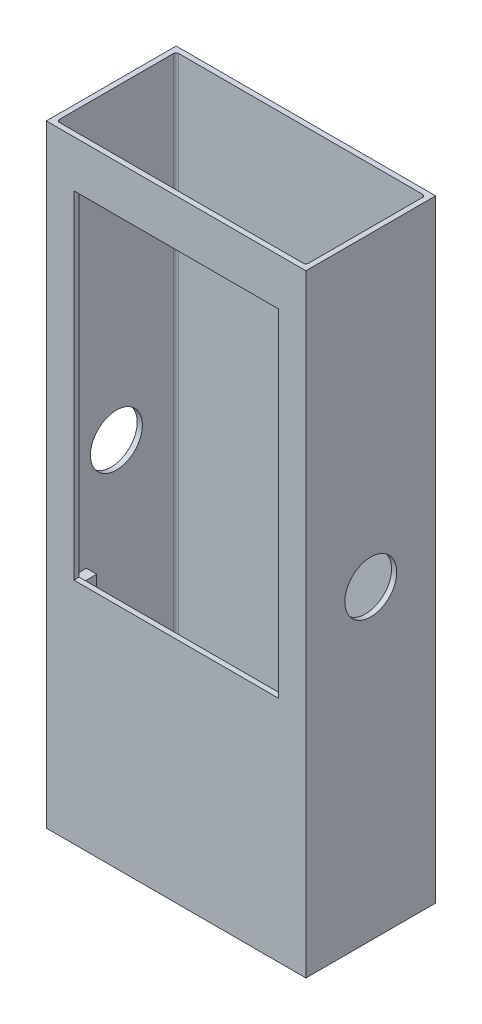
ISO-10303-21;
HEADER;
FILE_DESCRIPTION(('STEP AP214'),'2;1');
FILE_NAME('part.step','',(''),(''),'','','');
FILE_SCHEMA(('AUTOMOTIVE_DESIGN { 1 0 10303 214 1 1 1 1 }'));
ENDSEC;
DATA;
#1=APPLICATION_CONTEXT('core data for automotive mechanical design processes');
#2=APPLICATION_PROTOCOL_DEFINITION('international standard','automotive_design',2000,#1);
#3=PRODUCT_CONTEXT('',#1,'mechanical');
#4=PRODUCT('Part','Part','',(#3));
#5=PRODUCT_RELATED_PRODUCT_CATEGORY('part','',(#4));
#6=PRODUCT_DEFINITION_FORMATION('','',#4);
#7=PRODUCT_DEFINITION_CONTEXT('part definition',#1,'design');
#8=PRODUCT_DEFINITION('design','',#6,#7);
#9=PRODUCT_DEFINITION_SHAPE('','',#8);
#10=(LENGTH_UNIT() NAMED_UNIT(*) SI_UNIT(.MILLI.,.METRE.));
#11=(NAMED_UNIT(*) PLANE_ANGLE_UNIT() SI_UNIT($,.RADIAN.));
#12=(NAMED_UNIT(*) SI_UNIT($,.STERADIAN.) SOLID_ANGLE_UNIT());
#13=UNCERTAINTY_MEASURE_WITH_UNIT(LENGTH_MEASURE(1.E-05),#10,'distance_accuracy_value','');
#14=(GEOMETRIC_REPRESENTATION_CONTEXT(3) GLOBAL_UNCERTAINTY_ASSIGNED_CONTEXT((#13)) GLOBAL_UNIT_ASSIGNED_CONTEXT((#10,
#11,#12)) REPRESENTATION_CONTEXT('',''));
#15=CARTESIAN_POINT('',(0.,0.,0.));
#16=DIRECTION('',(0.,0.,1.));
#17=DIRECTION('',(1.,0.,0.));
#18=AXIS2_PLACEMENT_3D('',#15,#16,#17);
#19=CARTESIAN_POINT('',(0.,-2.53999999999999,-2.54));
#20=DIRECTION('',(0.,0.,-1.));
#21=DIRECTION('',(-1.,0.,0.));
#22=AXIS2_PLACEMENT_3D('',#19,#20,#21);
#23=PLANE('',#22);
#24=DIRECTION('',(1.,0.,0.));
#25=VECTOR('',#24,1.);
#26=CARTESIAN_POINT('',(0.,-17.860000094,-2.54));
#27=LINE('',#26,#25);
#28=CARTESIAN_POINT('',(112.884000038,-17.860000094,-2.54));
#29=VERTEX_POINT('',#28);
#30=CARTESIAN_POINT('',(117.964000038,-17.860000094,-2.54));
#31=VERTEX_POINT('',#30);
#32=EDGE_CURVE('E400',#29,#31,#27,.T.);
#33=ORIENTED_EDGE('',*,*,#32,.F.);
#34=DIRECTION('',(0.,1.,0.));
#35=VECTOR('',#34,1.);
#36=CARTESIAN_POINT('',(112.884000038,0.,-2.54));
#37=LINE('',#36,#35);
#38=CARTESIAN_POINT('',(112.884000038,-22.940000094,-2.54));
#39=VERTEX_POINT('',#38);
#40=EDGE_CURVE('E375',#39,#29,#37,.T.);
#41=ORIENTED_EDGE('',*,*,#40,.F.);
#42=DIRECTION('',(1.,0.,0.));
#43=VECTOR('',#42,1.);
#44=CARTESIAN_POINT('',(0.,-22.940000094,-2.54));
#45=LINE('',#44,#43);
#46=CARTESIAN_POINT('',(117.964000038,-22.940000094,-2.54));
#47=VERTEX_POINT('',#46);
#48=EDGE_CURVE('E381',#39,#47,#45,.T.);
#49=ORIENTED_EDGE('',*,*,#48,.T.);
#50=DIRECTION('',(0.,1.,0.));
#51=VECTOR('',#50,1.);
#52=CARTESIAN_POINT('',(117.964000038,0.,-2.54));
#53=LINE('',#52,#51);
#54=EDGE_CURVE('E404',#47,#31,#53,.T.);
#55=ORIENTED_EDGE('',*,*,#54,.T.);
#56=EDGE_LOOP('',(#33,#41,#49,#55));
#57=FACE_BOUND('',#56,.T.);
#58=DIRECTION('',(0.,1.,0.));
#59=VECTOR('',#58,1.);
#60=CARTESIAN_POINT('',(14.1160384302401,-22.940000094,-2.54));
#61=LINE('',#60,#59);
#62=CARTESIAN_POINT('',(14.1160384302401,-22.940000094,-2.54));
#63=VERTEX_POINT('',#62);
#64=CARTESIAN_POINT('',(14.1160384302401,-17.860000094,-2.54));
#65=VERTEX_POINT('',#64);
#66=EDGE_CURVE('E433',#63,#65,#61,.T.);
#67=ORIENTED_EDGE('',*,*,#66,.T.);
#68=DIRECTION('',(-1.,0.,0.));
#69=VECTOR('',#68,1.);
#70=CARTESIAN_POINT('',(11.5760384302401,-17.860000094,-2.54));
#71=LINE('',#70,#69);
#72=CARTESIAN_POINT('',(9.03603843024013,-17.860000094,-2.54));
#73=VERTEX_POINT('',#72);
#74=EDGE_CURVE('E428',#65,#73,#71,.T.);
#75=ORIENTED_EDGE('',*,*,#74,.T.);
#76=DIRECTION('',(0.,-1.,0.));
#77=VECTOR('',#76,1.);
#78=CARTESIAN_POINT('',(9.03603843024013,-17.860000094,-2.54));
#79=LINE('',#78,#77);
#80=CARTESIAN_POINT('',(9.03603843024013,-22.940000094,-2.54));
#81=VERTEX_POINT('',#80);
#82=EDGE_CURVE('E448',#73,#81,#79,.T.);
#83=ORIENTED_EDGE('',*,*,#82,.T.);
#84=DIRECTION('',(1.,0.,0.));
#85=VECTOR('',#84,1.);
#86=CARTESIAN_POINT('',(9.03603843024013,-22.940000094,-2.54));
#87=LINE('',#86,#85);
#88=EDGE_CURVE('E451',#81,#63,#87,.T.);
#89=ORIENTED_EDGE('',*,*,#88,.T.);
#90=EDGE_LOOP('',(#67,#75,#83,#89));
#91=FACE_BOUND('',#90,.T.);
#92=DIRECTION('',(-1.,0.,0.));
#93=VECTOR('',#92,1.);
#94=CARTESIAN_POINT('',(0.,-190.399999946,-2.54));
#95=LINE('',#94,#93);
#96=CARTESIAN_POINT('',(113.500000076,-190.399999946,-2.54));
#97=VERTEX_POINT('',#96);
#98=CARTESIAN_POINT('',(13.499999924,-190.399999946,-2.54));
#99=VERTEX_POINT('',#98);
#100=EDGE_CURVE('E656',#97,#99,#95,.T.);
#101=ORIENTED_EDGE('',*,*,#100,.F.);
#102=DIRECTION('',(0.,-1.,0.));
#103=VECTOR('',#102,1.);
#104=CARTESIAN_POINT('',(113.500000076,-2.53999999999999,-2.54));
#105=LINE('',#104,#103);
#106=CARTESIAN_POINT('',(113.500000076,-25.4,-2.54));
#107=VERTEX_POINT('',#106);
#108=EDGE_CURVE('E653',#107,#97,#105,.T.);
#109=ORIENTED_EDGE('',*,*,#108,.F.);
#110=DIRECTION('',(1.,0.,0.));
#111=VECTOR('',#110,1.);
#112=CARTESIAN_POINT('',(0.,-25.4,-2.54));
#113=LINE('',#112,#111);
#114=CARTESIAN_POINT('',(13.499999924,-25.4,-2.54));
#115=VERTEX_POINT('',#114);
#116=EDGE_CURVE('E650',#115,#107,#113,.T.);
#117=ORIENTED_EDGE('',*,*,#116,.F.);
#118=DIRECTION('',(0.,-1.,0.));
#119=VECTOR('',#118,1.);
#120=CARTESIAN_POINT('',(13.499999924,-2.53999999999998,-2.54));
#121=LINE('',#120,#119);
#122=EDGE_CURVE('E643',#115,#99,#121,.T.);
#123=ORIENTED_EDGE('',*,*,#122,.T.);
#124=EDGE_LOOP('',(#101,#109,#117,#123));
#125=FACE_BOUND('',#124,.T.);
#126=DIRECTION('',(1.,0.,0.));
#127=VECTOR('',#126,1.);
#128=CARTESIAN_POINT('',(0.,-2.53999999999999,-2.54));
#129=LINE('',#128,#127);
#130=CARTESIAN_POINT('',(3.81,-2.53999999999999,-2.54));
#131=VERTEX_POINT('',#130);
#132=CARTESIAN_POINT('',(123.19,-2.53999999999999,-2.54));
#133=VERTEX_POINT('',#132);
#134=EDGE_CURVE('E533',#131,#133,#129,.T.);
#135=ORIENTED_EDGE('',*,*,#134,.T.);
#136=DIRECTION('',(0.,-1.,0.));
#137=VECTOR('',#136,1.);
#138=CARTESIAN_POINT('',(123.19,-2.53999999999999,-2.54));
#139=LINE('',#138,#137);
#140=CARTESIAN_POINT('',(123.19,-302.26,-2.54));
#141=VERTEX_POINT('',#140);
#142=EDGE_CURVE('E614',#133,#141,#139,.T.);
#143=ORIENTED_EDGE('',*,*,#142,.T.);
#144=DIRECTION('',(1.,0.,0.));
#145=VECTOR('',#144,1.);
#146=CARTESIAN_POINT('',(0.,-302.26,-2.54));
#147=LINE('',#146,#145);
#148=CARTESIAN_POINT('',(3.81,-302.26,-2.54));
#149=VERTEX_POINT('',#148);
#150=EDGE_CURVE('E548',#149,#141,#147,.T.);
#151=ORIENTED_EDGE('',*,*,#150,.F.);
#152=DIRECTION('',(0.,-1.,0.));
#153=VECTOR('',#152,1.);
#154=CARTESIAN_POINT('',(3.81,-2.53999999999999,-2.54));
#155=LINE('',#154,#153);
#156=EDGE_CURVE('E604',#149,#131,#155,.F.);
#157=ORIENTED_EDGE('',*,*,#156,.T.);
#158=EDGE_LOOP('',(#135,#143,#151,#157));
#159=FACE_BOUND('',#158,.T.);
#160=DIRECTION('',(0.,-1.,0.));
#161=VECTOR('',#160,1.);
#162=CARTESIAN_POINT('',(112.884000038,0.,-2.54));
#163=LINE('',#162,#161);
#164=CARTESIAN_POINT('',(112.884000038,-192.859999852,-2.54));
#165=VERTEX_POINT('',#164);
#166=CARTESIAN_POINT('',(112.884000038,-197.939999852,-2.54));
#167=VERTEX_POINT('',#166);
#168=EDGE_CURVE('E286',#165,#167,#163,.T.);
#169=ORIENTED_EDGE('',*,*,#168,.T.);
#170=DIRECTION('',(1.,0.,0.));
#171=VECTOR('',#170,1.);
#172=CARTESIAN_POINT('',(0.,-197.939999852,-2.54));
#173=LINE('',#172,#171);
#174=CARTESIAN_POINT('',(117.964000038,-197.939999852,-2.54));
#175=VERTEX_POINT('',#174);
#176=EDGE_CURVE('E335',#167,#175,#173,.T.);
#177=ORIENTED_EDGE('',*,*,#176,.T.);
#178=DIRECTION('',(0.,-1.,0.));
#179=VECTOR('',#178,1.);
#180=CARTESIAN_POINT('',(117.964000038,0.,-2.54));
#181=LINE('',#180,#179);
#182=CARTESIAN_POINT('',(117.964000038,-192.859999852,-2.54));
#183=VERTEX_POINT('',#182);
#184=EDGE_CURVE('E355',#183,#175,#181,.T.);
#185=ORIENTED_EDGE('',*,*,#184,.F.);
#186=DIRECTION('',(1.,0.,0.));
#187=VECTOR('',#186,1.);
#188=CARTESIAN_POINT('',(0.,-192.859999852,-2.54));
#189=LINE('',#188,#187);
#190=EDGE_CURVE('E87',#165,#183,#189,.T.);
#191=ORIENTED_EDGE('',*,*,#190,.F.);
#192=EDGE_LOOP('',(#169,#177,#185,#191));
#193=FACE_BOUND('',#192,.T.);
#194=DIRECTION('',(0.,-1.,0.));
#195=VECTOR('',#194,1.);
#196=CARTESIAN_POINT('',(9.03599996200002,0.,-2.54));
#197=LINE('',#196,#195);
#198=CARTESIAN_POINT('',(9.03599996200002,-192.859999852,-2.54));
#199=VERTEX_POINT('',#198);
#200=CARTESIAN_POINT('',(9.03599996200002,-197.939999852,-2.54));
#201=VERTEX_POINT('',#200);
#202=EDGE_CURVE('E280',#199,#201,#197,.T.);
#203=ORIENTED_EDGE('',*,*,#202,.T.);
#204=DIRECTION('',(-1.,0.,0.));
#205=VECTOR('',#204,1.);
#206=CARTESIAN_POINT('',(0.,-197.939999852,-2.54));
#207=LINE('',#206,#205);
#208=CARTESIAN_POINT('',(14.115999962,-197.939999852,-2.54));
#209=VERTEX_POINT('',#208);
#210=EDGE_CURVE('E297',#209,#201,#207,.T.);
#211=ORIENTED_EDGE('',*,*,#210,.F.);
#212=DIRECTION('',(0.,-1.,0.));
#213=VECTOR('',#212,1.);
#214=CARTESIAN_POINT('',(14.115999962,0.,-2.54));
#215=LINE('',#214,#213);
#216=CARTESIAN_POINT('',(14.115999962,-192.859999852,-2.54));
#217=VERTEX_POINT('',#216);
#218=EDGE_CURVE('E319',#217,#209,#215,.T.);
#219=ORIENTED_EDGE('',*,*,#218,.F.);
#220=DIRECTION('',(-1.,0.,0.));
#221=VECTOR('',#220,1.);
#222=CARTESIAN_POINT('',(0.,-192.859999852,-2.54));
#223=LINE('',#222,#221);
#224=EDGE_CURVE('E316',#217,#199,#223,.T.);
#225=ORIENTED_EDGE('',*,*,#224,.T.);
#226=EDGE_LOOP('',(#203,#211,#219,#225));
#227=FACE_BOUND('',#226,.T.);
#228=ADVANCED_FACE('F63',(#57,#91,#125,#159,#193,#227),#23,.T.);
#229=CARTESIAN_POINT('',(0.,-302.26,0.));
#230=DIRECTION('',(-1.,0.,0.));
#231=DIRECTION('',(0.,0.,1.));
#232=AXIS2_PLACEMENT_3D('',#229,#230,#231);
#233=PLANE('',#232);
#234=DIRECTION('',(0.,0.,1.));
#235=VECTOR('',#234,1.);
#236=CARTESIAN_POINT('',(0.,-2.54,0.));
#237=LINE('',#236,#235);
#238=CARTESIAN_POINT('',(0.,-2.54,-63.5));
#239=VERTEX_POINT('',#238);
#240=CARTESIAN_POINT('',(0.,-2.53999999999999,0.));
#241=VERTEX_POINT('',#240);
#242=EDGE_CURVE('E500',#239,#241,#237,.T.);
#243=ORIENTED_EDGE('',*,*,#242,.F.);
#244=DIRECTION('',(0.,1.,0.));
#245=VECTOR('',#244,1.);
#246=CARTESIAN_POINT('',(0.,-302.26,-63.5));
#247=LINE('',#246,#245);
#248=CARTESIAN_POINT('',(0.,-302.26,-63.5));
#249=VERTEX_POINT('',#248);
#250=EDGE_CURVE('E571',#249,#239,#247,.T.);
#251=ORIENTED_EDGE('',*,*,#250,.F.);
#252=DIRECTION('',(0.,0.,1.));
#253=VECTOR('',#252,1.);
#254=CARTESIAN_POINT('',(0.,-302.26,0.));
#255=LINE('',#254,#253);
#256=CARTESIAN_POINT('',(0.,-302.26,0.));
#257=VERTEX_POINT('',#256);
#258=EDGE_CURVE('E541',#249,#257,#255,.T.);
#259=ORIENTED_EDGE('',*,*,#258,.T.);
#260=DIRECTION('',(0.,1.,0.));
#261=VECTOR('',#260,1.);
#262=CARTESIAN_POINT('',(0.,-302.26,0.));
#263=LINE('',#262,#261);
#264=EDGE_CURVE('E570',#257,#241,#263,.T.);
#265=ORIENTED_EDGE('',*,*,#264,.T.);
#266=EDGE_LOOP('',(#243,#251,#259,#265));
#267=FACE_BOUND('',#266,.T.);
#268=CARTESIAN_POINT('',(0.,-152.4,-31.75));
#269=DIRECTION('',(-1.,0.,0.));
#270=DIRECTION('',(0.,0.,1.));
#271=AXIS2_PLACEMENT_3D('',#268,#269,#270);
#272=CIRCLE('',#271,12.7);
#273=CARTESIAN_POINT('',(0.,-152.4,-19.05));
#274=VERTEX_POINT('',#273);
#275=EDGE_CURVE('E512',#274,#274,#272,.T.);
#276=ORIENTED_EDGE('',*,*,#275,.F.);
#277=EDGE_LOOP('',(#276));
#278=FACE_BOUND('',#277,.T.);
#279=ADVANCED_FACE('F697',(#267,#278),#233,.T.);
#280=CARTESIAN_POINT('',(0.,-302.26,-63.5));
#281=DIRECTION('',(0.,0.,-1.));
#282=DIRECTION('',(-1.,0.,0.));
#283=AXIS2_PLACEMENT_3D('',#280,#281,#282);
#284=PLANE('',#283);
#285=DIRECTION('',(-1.,0.,0.));
#286=VECTOR('',#285,1.);
#287=CARTESIAN_POINT('',(0.,-2.54,-63.5));
#288=LINE('',#287,#286);
#289=CARTESIAN_POINT('',(127.,-2.54,-63.5));
#290=VERTEX_POINT('',#289);
#291=EDGE_CURVE('E509',#290,#239,#288,.T.);
#292=ORIENTED_EDGE('',*,*,#291,.F.);
#293=DIRECTION('',(0.,1.,0.));
#294=VECTOR('',#293,1.);
#295=CARTESIAN_POINT('',(127.,-302.26,-63.5));
#296=LINE('',#295,#294);
#297=CARTESIAN_POINT('',(127.,-302.26,-63.5));
#298=VERTEX_POINT('',#297);
#299=EDGE_CURVE('E576',#298,#290,#296,.T.);
#300=ORIENTED_EDGE('',*,*,#299,.F.);
#301=DIRECTION('',(-1.,0.,0.));
#302=VECTOR('',#301,1.);
#303=CARTESIAN_POINT('',(0.,-302.26,-63.5));
#304=LINE('',#303,#302);
#305=EDGE_CURVE('E566',#298,#249,#304,.T.);
#306=ORIENTED_EDGE('',*,*,#305,.T.);
#307=ORIENTED_EDGE('',*,*,#250,.T.);
#308=EDGE_LOOP('',(#292,#300,#306,#307));
#309=FACE_BOUND('',#308,.T.);
#310=ADVANCED_FACE('F702',(#309),#284,.T.);
#311=CARTESIAN_POINT('',(127.,-302.26,0.));
#312=DIRECTION('',(1.,0.,0.));
#313=DIRECTION('',(0.,0.,-1.));
#314=AXIS2_PLACEMENT_3D('',#311,#312,#313);
#315=PLANE('',#314);
#316=DIRECTION('',(0.,0.,-1.));
#317=VECTOR('',#316,1.);
#318=CARTESIAN_POINT('',(127.,-2.54,0.));
#319=LINE('',#318,#317);
#320=CARTESIAN_POINT('',(127.,-2.54,0.));
#321=VERTEX_POINT('',#320);
#322=EDGE_CURVE('E506',#321,#290,#319,.T.);
#323=ORIENTED_EDGE('',*,*,#322,.F.);
#324=DIRECTION('',(0.,1.,0.));
#325=VECTOR('',#324,1.);
#326=CARTESIAN_POINT('',(127.,-302.26,0.));
#327=LINE('',#326,#325);
#328=CARTESIAN_POINT('',(127.,-302.26,0.));
#329=VERTEX_POINT('',#328);
#330=EDGE_CURVE('E580',#329,#321,#327,.T.);
#331=ORIENTED_EDGE('',*,*,#330,.F.);
#332=DIRECTION('',(0.,0.,-1.));
#333=VECTOR('',#332,1.);
#334=CARTESIAN_POINT('',(127.,-302.26,0.));
#335=LINE('',#334,#333);
#336=EDGE_CURVE('E562',#329,#298,#335,.T.);
#337=ORIENTED_EDGE('',*,*,#336,.T.);
#338=ORIENTED_EDGE('',*,*,#299,.T.);
#339=EDGE_LOOP('',(#323,#331,#337,#338));
#340=FACE_BOUND('',#339,.T.);
#341=CARTESIAN_POINT('',(127.,-152.4,-31.75));
#342=DIRECTION('',(1.,0.,0.));
#343=DIRECTION('',(0.,0.,-1.));
#344=AXIS2_PLACEMENT_3D('',#341,#342,#343);
#345=CIRCLE('',#344,12.7);
#346=CARTESIAN_POINT('',(127.,-152.4,-44.45));
#347=VERTEX_POINT('',#346);
#348=EDGE_CURVE('E521',#347,#347,#345,.T.);
#349=ORIENTED_EDGE('',*,*,#348,.F.);
#350=EDGE_LOOP('',(#349));
#351=FACE_BOUND('',#350,.T.);
#352=ADVANCED_FACE('F844',(#340,#351),#315,.T.);
#353=CARTESIAN_POINT('',(0.,-302.26,0.));
#354=DIRECTION('',(0.,0.,1.));
#355=DIRECTION('',(1.,0.,0.));
#356=AXIS2_PLACEMENT_3D('',#353,#354,#355);
#357=PLANE('',#356);
#358=DIRECTION('',(1.,0.,0.));
#359=VECTOR('',#358,1.);
#360=CARTESIAN_POINT('',(0.,-190.399999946,0.));
#361=LINE('',#360,#359);
#362=CARTESIAN_POINT('',(13.499999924,-190.399999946,0.));
#363=VERTEX_POINT('',#362);
#364=CARTESIAN_POINT('',(113.500000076,-190.399999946,0.));
#365=VERTEX_POINT('',#364);
#366=EDGE_CURVE('E497',#363,#365,#361,.T.);
#367=ORIENTED_EDGE('',*,*,#366,.F.);
#368=DIRECTION('',(0.,1.,0.));
#369=VECTOR('',#368,1.);
#370=CARTESIAN_POINT('',(13.499999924,-302.26,0.));
#371=LINE('',#370,#369);
#372=CARTESIAN_POINT('',(13.499999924,-25.4,0.));
#373=VERTEX_POINT('',#372);
#374=EDGE_CURVE('E486',#363,#373,#371,.T.);
#375=ORIENTED_EDGE('',*,*,#374,.T.);
#376=DIRECTION('',(-1.,0.,0.));
#377=VECTOR('',#376,1.);
#378=CARTESIAN_POINT('',(0.,-25.4,0.));
#379=LINE('',#378,#377);
#380=CARTESIAN_POINT('',(113.500000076,-25.4,0.));
#381=VERTEX_POINT('',#380);
#382=EDGE_CURVE('E490',#381,#373,#379,.T.);
#383=ORIENTED_EDGE('',*,*,#382,.F.);
#384=DIRECTION('',(0.,1.,0.));
#385=VECTOR('',#384,1.);
#386=CARTESIAN_POINT('',(113.500000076,-302.26,0.));
#387=LINE('',#386,#385);
#388=EDGE_CURVE('E494',#365,#381,#387,.T.);
#389=ORIENTED_EDGE('',*,*,#388,.F.);
#390=EDGE_LOOP('',(#367,#375,#383,#389));
#391=FACE_BOUND('',#390,.T.);
#392=DIRECTION('',(1.,0.,0.));
#393=VECTOR('',#392,1.);
#394=CARTESIAN_POINT('',(0.,-2.54,0.));
#395=LINE('',#394,#393);
#396=EDGE_CURVE('E503',#241,#321,#395,.T.);
#397=ORIENTED_EDGE('',*,*,#396,.F.);
#398=ORIENTED_EDGE('',*,*,#264,.F.);
#399=DIRECTION('',(1.,0.,0.));
#400=VECTOR('',#399,1.);
#401=CARTESIAN_POINT('',(0.,-302.26,0.));
#402=LINE('',#401,#400);
#403=EDGE_CURVE('E558',#257,#329,#402,.T.);
#404=ORIENTED_EDGE('',*,*,#403,.T.);
#405=ORIENTED_EDGE('',*,*,#330,.T.);
#406=EDGE_LOOP('',(#397,#398,#404,#405));
#407=FACE_BOUND('',#406,.T.);
#408=ADVANCED_FACE('F836',(#391,#407),#357,.T.);
#409=CARTESIAN_POINT('',(0.,-302.26,0.));
#410=DIRECTION('',(0.,-1.,0.));
#411=DIRECTION('',(0.,0.,-1.));
#412=AXIS2_PLACEMENT_3D('',#409,#410,#411);
#413=PLANE('',#412);
#414=DIRECTION('',(1.,0.,0.));
#415=VECTOR('',#414,1.);
#416=CARTESIAN_POINT('',(0.,-302.26,-60.96));
#417=LINE('',#416,#415);
#418=CARTESIAN_POINT('',(3.81,-302.26,-60.96));
#419=VERTEX_POINT('',#418);
#420=CARTESIAN_POINT('',(123.19,-302.26,-60.96));
#421=VERTEX_POINT('',#420);
#422=EDGE_CURVE('E525',#419,#421,#417,.T.);
#423=ORIENTED_EDGE('',*,*,#422,.F.);
#424=CARTESIAN_POINT('',(3.81,-302.26,-59.69));
#425=DIRECTION('',(0.,-1.,0.));
#426=DIRECTION('',(0.,0.,-1.));
#427=AXIS2_PLACEMENT_3D('',#424,#425,#426);
#428=CIRCLE('',#427,1.27);
#429=CARTESIAN_POINT('',(2.54,-302.26,-59.69));
#430=VERTEX_POINT('',#429);
#431=EDGE_CURVE('E597',#419,#430,#428,.F.);
#432=ORIENTED_EDGE('',*,*,#431,.T.);
#433=DIRECTION('',(0.,0.,1.));
#434=VECTOR('',#433,1.);
#435=CARTESIAN_POINT('',(2.54,-302.26,0.));
#436=LINE('',#435,#434);
#437=CARTESIAN_POINT('',(2.54,-302.26,-3.81));
#438=VERTEX_POINT('',#437);
#439=EDGE_CURVE('E530',#430,#438,#436,.T.);
#440=ORIENTED_EDGE('',*,*,#439,.T.);
#441=CARTESIAN_POINT('',(3.81,-302.26,-3.81));
#442=DIRECTION('',(0.,-1.,0.));
#443=DIRECTION('',(0.,0.,-1.));
#444=AXIS2_PLACEMENT_3D('',#441,#442,#443);
#445=CIRCLE('',#444,1.27);
#446=EDGE_CURVE('E611',#438,#149,#445,.F.);
#447=ORIENTED_EDGE('',*,*,#446,.T.);
#448=ORIENTED_EDGE('',*,*,#150,.T.);
#449=CARTESIAN_POINT('',(123.19,-302.26,-3.81));
#450=DIRECTION('',(0.,-1.,0.));
#451=DIRECTION('',(0.,0.,-1.));
#452=AXIS2_PLACEMENT_3D('',#449,#450,#451);
#453=CIRCLE('',#452,1.27);
#454=CARTESIAN_POINT('',(124.46,-302.26,-3.81));
#455=VERTEX_POINT('',#454);
#456=EDGE_CURVE('E625',#141,#455,#453,.F.);
#457=ORIENTED_EDGE('',*,*,#456,.T.);
#458=DIRECTION('',(0.,0.,1.));
#459=VECTOR('',#458,1.);
#460=CARTESIAN_POINT('',(124.46,-302.26,0.));
#461=LINE('',#460,#459);
#462=CARTESIAN_POINT('',(124.46,-302.26,-59.69));
#463=VERTEX_POINT('',#462);
#464=EDGE_CURVE('E545',#463,#455,#461,.T.);
#465=ORIENTED_EDGE('',*,*,#464,.F.);
#466=CARTESIAN_POINT('',(123.19,-302.26,-59.69));
#467=DIRECTION('',(0.,-1.,0.));
#468=DIRECTION('',(0.,0.,-1.));
#469=AXIS2_PLACEMENT_3D('',#466,#467,#468);
#470=CIRCLE('',#469,1.27);
#471=EDGE_CURVE('E640',#463,#421,#470,.F.);
#472=ORIENTED_EDGE('',*,*,#471,.T.);
#473=EDGE_LOOP('',(#423,#432,#440,#447,#448,#457,#465,#472));
#474=FACE_BOUND('',#473,.T.);
#475=ORIENTED_EDGE('',*,*,#258,.F.);
#476=ORIENTED_EDGE('',*,*,#305,.F.);
#477=ORIENTED_EDGE('',*,*,#336,.F.);
#478=ORIENTED_EDGE('',*,*,#403,.F.);
#479=EDGE_LOOP('',(#475,#476,#477,#478));
#480=FACE_BOUND('',#479,.T.);
#481=ADVANCED_FACE('F797',(#474,#480),#413,.T.);
#482=CARTESIAN_POINT('',(0.,-2.53999999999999,-60.96));
#483=DIRECTION('',(0.,0.,-1.));
#484=DIRECTION('',(-1.,0.,0.));
#485=AXIS2_PLACEMENT_3D('',#482,#483,#484);
#486=PLANE('',#485);
#487=ORIENTED_EDGE('',*,*,#422,.T.);
#488=DIRECTION('',(0.,-1.,0.));
#489=VECTOR('',#488,1.);
#490=CARTESIAN_POINT('',(123.19,-2.53999999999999,-60.96));
#491=LINE('',#490,#489);
#492=CARTESIAN_POINT('',(123.19,-2.53999999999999,-60.96));
#493=VERTEX_POINT('',#492);
#494=EDGE_CURVE('E633',#421,#493,#491,.F.);
#495=ORIENTED_EDGE('',*,*,#494,.T.);
#496=DIRECTION('',(1.,0.,0.));
#497=VECTOR('',#496,1.);
#498=CARTESIAN_POINT('',(0.,-2.53999999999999,-60.96));
#499=LINE('',#498,#497);
#500=CARTESIAN_POINT('',(3.81,-2.53999999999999,-60.96));
#501=VERTEX_POINT('',#500);
#502=EDGE_CURVE('E526',#501,#493,#499,.T.);
#503=ORIENTED_EDGE('',*,*,#502,.F.);
#504=DIRECTION('',(0.,-1.,0.));
#505=VECTOR('',#504,1.);
#506=CARTESIAN_POINT('',(3.81,-2.53999999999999,-60.96));
#507=LINE('',#506,#505);
#508=EDGE_CURVE('E575',#501,#419,#507,.T.);
#509=ORIENTED_EDGE('',*,*,#508,.T.);
#510=EDGE_LOOP('',(#487,#495,#503,#509));
#511=FACE_BOUND('',#510,.T.);
#512=ADVANCED_FACE('F789',(#511),#486,.F.);
#513=CARTESIAN_POINT('',(2.54,-2.53999999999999,0.));
#514=DIRECTION('',(1.,0.,0.));
#515=DIRECTION('',(0.,0.,-1.));
#516=AXIS2_PLACEMENT_3D('',#513,#514,#515);
#517=PLANE('',#516);
#518=CARTESIAN_POINT('',(2.53999999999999,-152.4,-31.75));
#519=DIRECTION('',(1.,0.,0.));
#520=DIRECTION('',(0.,0.,-1.));
#521=AXIS2_PLACEMENT_3D('',#518,#519,#520);
#522=CIRCLE('',#521,12.7);
#523=CARTESIAN_POINT('',(2.53999999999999,-152.4,-44.45));
#524=VERTEX_POINT('',#523);
#525=EDGE_CURVE('E517',#524,#524,#522,.T.);
#526=ORIENTED_EDGE('',*,*,#525,.F.);
#527=EDGE_LOOP('',(#526));
#528=FACE_BOUND('',#527,.T.);
#529=DIRECTION('',(0.,0.,1.));
#530=VECTOR('',#529,1.);
#531=CARTESIAN_POINT('',(2.54,-2.53999999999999,0.));
#532=LINE('',#531,#530);
#533=CARTESIAN_POINT('',(2.54,-2.53999999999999,-59.69));
#534=VERTEX_POINT('',#533);
#535=CARTESIAN_POINT('',(2.54,-2.53999999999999,-3.81));
#536=VERTEX_POINT('',#535);
#537=EDGE_CURVE('E537',#534,#536,#532,.T.);
#538=ORIENTED_EDGE('',*,*,#537,.T.);
#539=DIRECTION('',(0.,-1.,0.));
#540=VECTOR('',#539,1.);
#541=CARTESIAN_POINT('',(2.54,-302.26,-3.81));
#542=LINE('',#541,#540);
#543=EDGE_CURVE('E600',#536,#438,#542,.T.);
#544=ORIENTED_EDGE('',*,*,#543,.T.);
#545=ORIENTED_EDGE('',*,*,#439,.F.);
#546=DIRECTION('',(0.,-1.,0.));
#547=VECTOR('',#546,1.);
#548=CARTESIAN_POINT('',(2.54,-2.53999999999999,-59.69));
#549=LINE('',#548,#547);
#550=EDGE_CURVE('E590',#430,#534,#549,.F.);
#551=ORIENTED_EDGE('',*,*,#550,.T.);
#552=EDGE_LOOP('',(#538,#544,#545,#551));
#553=FACE_BOUND('',#552,.T.);
#554=ADVANCED_FACE('F786',(#528,#553),#517,.T.);
#555=CARTESIAN_POINT('',(124.46,-2.53999999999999,0.));
#556=DIRECTION('',(1.,0.,0.));
#557=DIRECTION('',(0.,0.,-1.));
#558=AXIS2_PLACEMENT_3D('',#555,#556,#557);
#559=PLANE('',#558);
#560=CARTESIAN_POINT('',(124.46,-152.4,-31.75));
#561=DIRECTION('',(1.,0.,0.));
#562=DIRECTION('',(0.,0.,-1.));
#563=AXIS2_PLACEMENT_3D('',#560,#561,#562);
#564=CIRCLE('',#563,12.7);
#565=CARTESIAN_POINT('',(124.46,-152.4,-44.45));
#566=VERTEX_POINT('',#565);
#567=EDGE_CURVE('E516',#566,#566,#564,.T.);
#568=ORIENTED_EDGE('',*,*,#567,.T.);
#569=EDGE_LOOP('',(#568));
#570=FACE_BOUND('',#569,.T.);
#571=DIRECTION('',(0.,0.,1.));
#572=VECTOR('',#571,1.);
#573=CARTESIAN_POINT('',(124.46,-2.53999999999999,0.));
#574=LINE('',#573,#572);
#575=CARTESIAN_POINT('',(124.46,-2.53999999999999,-59.69));
#576=VERTEX_POINT('',#575);
#577=CARTESIAN_POINT('',(124.46,-2.53999999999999,-3.81));
#578=VERTEX_POINT('',#577);
#579=EDGE_CURVE('E529',#576,#578,#574,.T.);
#580=ORIENTED_EDGE('',*,*,#579,.F.);
#581=DIRECTION('',(0.,-1.,0.));
#582=VECTOR('',#581,1.);
#583=CARTESIAN_POINT('',(124.46,-302.26,-59.69));
#584=LINE('',#583,#582);
#585=EDGE_CURVE('E629',#576,#463,#584,.T.);
#586=ORIENTED_EDGE('',*,*,#585,.T.);
#587=ORIENTED_EDGE('',*,*,#464,.T.);
#588=DIRECTION('',(0.,-1.,0.));
#589=VECTOR('',#588,1.);
#590=CARTESIAN_POINT('',(124.46,-2.53999999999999,-3.81));
#591=LINE('',#590,#589);
#592=EDGE_CURVE('E618',#455,#578,#591,.F.);
#593=ORIENTED_EDGE('',*,*,#592,.T.);
#594=EDGE_LOOP('',(#580,#586,#587,#593));
#595=FACE_BOUND('',#594,.T.);
#596=ADVANCED_FACE('F788',(#570,#595),#559,.F.);
#597=CARTESIAN_POINT('',(3.81,-2.53999999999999,-59.69));
#598=DIRECTION('',(0.,-1.,0.));
#599=DIRECTION('',(0.,0.,-1.));
#600=AXIS2_PLACEMENT_3D('',#597,#598,#599);
#601=CYLINDRICAL_SURFACE('',#600,1.27);
#602=CARTESIAN_POINT('',(3.81,-2.53999999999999,-59.69));
#603=DIRECTION('',(0.,-1.,0.));
#604=DIRECTION('',(0.,0.,-1.));
#605=AXIS2_PLACEMENT_3D('',#602,#603,#604);
#606=CIRCLE('',#605,1.27);
#607=EDGE_CURVE('E594',#534,#501,#606,.T.);
#608=ORIENTED_EDGE('',*,*,#607,.F.);
#609=ORIENTED_EDGE('',*,*,#550,.F.);
#610=ORIENTED_EDGE('',*,*,#431,.F.);
#611=ORIENTED_EDGE('',*,*,#508,.F.);
#612=EDGE_LOOP('',(#608,#609,#610,#611));
#613=FACE_BOUND('',#612,.T.);
#614=ADVANCED_FACE('F795',(#613),#601,.F.);
#615=CARTESIAN_POINT('',(3.81,-2.53999999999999,-3.81));
#616=DIRECTION('',(0.,1.,0.));
#617=DIRECTION('',(0.,0.,1.));
#618=AXIS2_PLACEMENT_3D('',#615,#616,#617);
#619=CYLINDRICAL_SURFACE('',#618,1.27);
#620=CARTESIAN_POINT('',(3.81,-2.53999999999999,-3.81));
#621=DIRECTION('',(0.,-1.,0.));
#622=DIRECTION('',(0.,0.,-1.));
#623=AXIS2_PLACEMENT_3D('',#620,#621,#622);
#624=CIRCLE('',#623,1.27);
#625=EDGE_CURVE('E608',#131,#536,#624,.T.);
#626=ORIENTED_EDGE('',*,*,#625,.F.);
#627=ORIENTED_EDGE('',*,*,#156,.F.);
#628=ORIENTED_EDGE('',*,*,#446,.F.);
#629=ORIENTED_EDGE('',*,*,#543,.F.);
#630=EDGE_LOOP('',(#626,#627,#628,#629));
#631=FACE_BOUND('',#630,.T.);
#632=ADVANCED_FACE('F808',(#631),#619,.F.);
#633=CARTESIAN_POINT('',(123.19,-2.53999999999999,-3.81));
#634=DIRECTION('',(0.,-1.,0.));
#635=DIRECTION('',(0.,0.,-1.));
#636=AXIS2_PLACEMENT_3D('',#633,#634,#635);
#637=CYLINDRICAL_SURFACE('',#636,1.27);
#638=CARTESIAN_POINT('',(123.19,-2.53999999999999,-3.81));
#639=DIRECTION('',(0.,-1.,0.));
#640=DIRECTION('',(0.,0.,-1.));
#641=AXIS2_PLACEMENT_3D('',#638,#639,#640);
#642=CIRCLE('',#641,1.27);
#643=EDGE_CURVE('E622',#578,#133,#642,.T.);
#644=ORIENTED_EDGE('',*,*,#643,.F.);
#645=ORIENTED_EDGE('',*,*,#592,.F.);
#646=ORIENTED_EDGE('',*,*,#456,.F.);
#647=ORIENTED_EDGE('',*,*,#142,.F.);
#648=EDGE_LOOP('',(#644,#645,#646,#647));
#649=FACE_BOUND('',#648,.T.);
#650=ADVANCED_FACE('F818',(#649),#637,.F.);
#651=CARTESIAN_POINT('',(123.19,-2.53999999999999,-59.69));
#652=DIRECTION('',(0.,1.,0.));
#653=DIRECTION('',(0.,0.,1.));
#654=AXIS2_PLACEMENT_3D('',#651,#652,#653);
#655=CYLINDRICAL_SURFACE('',#654,1.27);
#656=CARTESIAN_POINT('',(123.19,-2.53999999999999,-59.69));
#657=DIRECTION('',(0.,-1.,0.));
#658=DIRECTION('',(0.,0.,-1.));
#659=AXIS2_PLACEMENT_3D('',#656,#657,#658);
#660=CIRCLE('',#659,1.27);
#661=EDGE_CURVE('E637',#493,#576,#660,.T.);
#662=ORIENTED_EDGE('',*,*,#661,.F.);
#663=ORIENTED_EDGE('',*,*,#494,.F.);
#664=ORIENTED_EDGE('',*,*,#471,.F.);
#665=ORIENTED_EDGE('',*,*,#585,.F.);
#666=EDGE_LOOP('',(#662,#663,#664,#665));
#667=FACE_BOUND('',#666,.T.);
#668=ADVANCED_FACE('F65',(#667),#655,.F.);
#669=CARTESIAN_POINT('',(254.,-152.4,-31.75));
#670=DIRECTION('',(-1.,0.,0.));
#671=DIRECTION('',(0.,0.,1.));
#672=AXIS2_PLACEMENT_3D('',#669,#670,#671);
#673=CYLINDRICAL_SURFACE('',#672,12.7);
#674=ORIENTED_EDGE('',*,*,#348,.T.);
#675=EDGE_LOOP('',(#674));
#676=FACE_BOUND('',#675,.T.);
#677=ORIENTED_EDGE('',*,*,#567,.F.);
#678=EDGE_LOOP('',(#677));
#679=FACE_BOUND('',#678,.T.);
#680=ADVANCED_FACE('F784',(#676,#679),#673,.F.);
#681=ORIENTED_EDGE('',*,*,#525,.T.);
#682=EDGE_LOOP('',(#681));
#683=FACE_BOUND('',#682,.T.);
#684=ORIENTED_EDGE('',*,*,#275,.T.);
#685=EDGE_LOOP('',(#684));
#686=FACE_BOUND('',#685,.T.);
#687=ADVANCED_FACE('F781',(#683,#686),#673,.F.);
#688=CARTESIAN_POINT('',(0.,-2.54,0.));
#689=DIRECTION('',(0.,-1.,0.));
#690=DIRECTION('',(0.,0.,-1.));
#691=AXIS2_PLACEMENT_3D('',#688,#689,#690);
#692=PLANE('',#691);
#693=ORIENTED_EDGE('',*,*,#502,.T.);
#694=ORIENTED_EDGE('',*,*,#661,.T.);
#695=ORIENTED_EDGE('',*,*,#579,.T.);
#696=ORIENTED_EDGE('',*,*,#643,.T.);
#697=ORIENTED_EDGE('',*,*,#134,.F.);
#698=ORIENTED_EDGE('',*,*,#625,.T.);
#699=ORIENTED_EDGE('',*,*,#537,.F.);
#700=ORIENTED_EDGE('',*,*,#607,.T.);
#701=EDGE_LOOP('',(#693,#694,#695,#696,#697,#698,#699,#700));
#702=FACE_BOUND('',#701,.T.);
#703=ORIENTED_EDGE('',*,*,#242,.T.);
#704=ORIENTED_EDGE('',*,*,#396,.T.);
#705=ORIENTED_EDGE('',*,*,#322,.T.);
#706=ORIENTED_EDGE('',*,*,#291,.T.);
#707=EDGE_LOOP('',(#703,#704,#705,#706));
#708=FACE_BOUND('',#707,.T.);
#709=ADVANCED_FACE('F777',(#702,#708),#692,.F.);
#710=CARTESIAN_POINT('',(0.,-190.399999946,8.12799999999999));
#711=DIRECTION('',(0.,-1.,0.));
#712=DIRECTION('',(0.,0.,-1.));
#713=AXIS2_PLACEMENT_3D('',#710,#711,#712);
#714=PLANE('',#713);
#715=ORIENTED_EDGE('',*,*,#366,.T.);
#716=DIRECTION('',(0.,0.,-1.));
#717=VECTOR('',#716,1.);
#718=CARTESIAN_POINT('',(113.500000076,-190.399999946,8.12799999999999));
#719=LINE('',#718,#717);
#720=EDGE_CURVE('E482',#365,#97,#719,.T.);
#721=ORIENTED_EDGE('',*,*,#720,.T.);
#722=ORIENTED_EDGE('',*,*,#100,.T.);
#723=DIRECTION('',(0.,0.,-1.));
#724=VECTOR('',#723,1.);
#725=CARTESIAN_POINT('',(13.499999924,-190.399999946,8.12799999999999));
#726=LINE('',#725,#724);
#727=EDGE_CURVE('E460',#363,#99,#726,.T.);
#728=ORIENTED_EDGE('',*,*,#727,.F.);
#729=EDGE_LOOP('',(#715,#721,#722,#728));
#730=FACE_BOUND('',#729,.T.);
#731=ADVANCED_FACE('F773',(#730),#714,.F.);
#732=CARTESIAN_POINT('',(113.500000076,0.,8.12799999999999));
#733=DIRECTION('',(1.,0.,0.));
#734=DIRECTION('',(0.,0.,-1.));
#735=AXIS2_PLACEMENT_3D('',#732,#733,#734);
#736=PLANE('',#735);
#737=ORIENTED_EDGE('',*,*,#388,.T.);
#738=DIRECTION('',(0.,0.,-1.));
#739=VECTOR('',#738,1.);
#740=CARTESIAN_POINT('',(113.500000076,-25.4,8.12799999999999));
#741=LINE('',#740,#739);
#742=EDGE_CURVE('E478',#381,#107,#741,.T.);
#743=ORIENTED_EDGE('',*,*,#742,.T.);
#744=ORIENTED_EDGE('',*,*,#108,.T.);
#745=ORIENTED_EDGE('',*,*,#720,.F.);
#746=EDGE_LOOP('',(#737,#743,#744,#745));
#747=FACE_BOUND('',#746,.T.);
#748=ADVANCED_FACE('F769',(#747),#736,.F.);
#749=CARTESIAN_POINT('',(0.,-25.4,8.12799999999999));
#750=DIRECTION('',(0.,1.,0.));
#751=DIRECTION('',(0.,0.,1.));
#752=AXIS2_PLACEMENT_3D('',#749,#750,#751);
#753=PLANE('',#752);
#754=ORIENTED_EDGE('',*,*,#382,.T.);
#755=DIRECTION('',(0.,0.,-1.));
#756=VECTOR('',#755,1.);
#757=CARTESIAN_POINT('',(13.499999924,-25.4,8.12799999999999));
#758=LINE('',#757,#756);
#759=EDGE_CURVE('E474',#373,#115,#758,.T.);
#760=ORIENTED_EDGE('',*,*,#759,.T.);
#761=ORIENTED_EDGE('',*,*,#116,.T.);
#762=ORIENTED_EDGE('',*,*,#742,.F.);
#763=EDGE_LOOP('',(#754,#760,#761,#762));
#764=FACE_BOUND('',#763,.T.);
#765=ADVANCED_FACE('F765',(#764),#753,.F.);
#766=CARTESIAN_POINT('',(13.499999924,0.,8.12799999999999));
#767=DIRECTION('',(1.,0.,0.));
#768=DIRECTION('',(0.,1.,0.));
#769=AXIS2_PLACEMENT_3D('',#766,#767,#768);
#770=PLANE('',#769);
#771=ORIENTED_EDGE('',*,*,#727,.T.);
#772=ORIENTED_EDGE('',*,*,#122,.F.);
#773=ORIENTED_EDGE('',*,*,#759,.F.);
#774=ORIENTED_EDGE('',*,*,#374,.F.);
#775=EDGE_LOOP('',(#771,#772,#773,#774));
#776=FACE_BOUND('',#775,.T.);
#777=ADVANCED_FACE('F747',(#776),#770,.T.);
#778=CARTESIAN_POINT('',(0.,0.,-10.540000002));
#779=DIRECTION('',(0.,0.,1.));
#780=DIRECTION('',(1.,0.,0.));
#781=AXIS2_PLACEMENT_3D('',#778,#779,#780);
#782=PLANE('',#781);
#783=DIRECTION('',(-1.,0.,0.));
#784=VECTOR('',#783,1.);
#785=CARTESIAN_POINT('',(14.1160384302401,-17.860000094,-10.540000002));
#786=LINE('',#785,#784);
#787=CARTESIAN_POINT('',(14.1160384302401,-17.860000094,-10.540000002));
#788=VERTEX_POINT('',#787);
#789=CARTESIAN_POINT('',(9.03603843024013,-17.860000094,-10.540000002));
#790=VERTEX_POINT('',#789);
#791=EDGE_CURVE('E429',#788,#790,#786,.T.);
#792=ORIENTED_EDGE('',*,*,#791,.F.);
#793=DIRECTION('',(0.,1.,0.));
#794=VECTOR('',#793,1.);
#795=CARTESIAN_POINT('',(14.1160384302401,-22.940000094,-10.540000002));
#796=LINE('',#795,#794);
#797=CARTESIAN_POINT('',(14.1160384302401,-22.940000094,-10.540000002));
#798=VERTEX_POINT('',#797);
#799=EDGE_CURVE('E441',#798,#788,#796,.T.);
#800=ORIENTED_EDGE('',*,*,#799,.F.);
#801=DIRECTION('',(1.,0.,0.));
#802=VECTOR('',#801,1.);
#803=CARTESIAN_POINT('',(9.03603843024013,-22.940000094,-10.540000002));
#804=LINE('',#803,#802);
#805=CARTESIAN_POINT('',(9.03603843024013,-22.940000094,-10.540000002));
#806=VERTEX_POINT('',#805);
#807=EDGE_CURVE('E437',#806,#798,#804,.T.);
#808=ORIENTED_EDGE('',*,*,#807,.F.);
#809=DIRECTION('',(0.,-1.,0.));
#810=VECTOR('',#809,1.);
#811=CARTESIAN_POINT('',(9.03603843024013,-17.860000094,-10.540000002));
#812=LINE('',#811,#810);
#813=EDGE_CURVE('E432',#790,#806,#812,.T.);
#814=ORIENTED_EDGE('',*,*,#813,.F.);
#815=EDGE_LOOP('',(#792,#800,#808,#814));
#816=FACE_BOUND('',#815,.T.);
#817=CARTESIAN_POINT('',(11.5760384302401,-20.400000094,-10.540000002));
#818=DIRECTION('',(0.,0.,-1.));
#819=DIRECTION('',(-1.,0.,0.));
#820=AXIS2_PLACEMENT_3D('',#817,#818,#819);
#821=CIRCLE('',#820,1.600000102);
#822=CARTESIAN_POINT('',(9.97603832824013,-20.400000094,-10.540000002));
#823=VERTEX_POINT('',#822);
#824=EDGE_CURVE('E424',#823,#823,#821,.T.);
#825=ORIENTED_EDGE('',*,*,#824,.F.);
#826=EDGE_LOOP('',(#825));
#827=FACE_BOUND('',#826,.T.);
#828=ADVANCED_FACE('F743',(#816,#827),#782,.F.);
#829=CARTESIAN_POINT('',(14.1160384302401,-22.940000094,-10.540000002));
#830=DIRECTION('',(1.,0.,0.));
#831=DIRECTION('',(0.,0.,-1.));
#832=AXIS2_PLACEMENT_3D('',#829,#830,#831);
#833=PLANE('',#832);
#834=ORIENTED_EDGE('',*,*,#66,.F.);
#835=DIRECTION('',(0.,0.,1.));
#836=VECTOR('',#835,1.);
#837=CARTESIAN_POINT('',(14.1160384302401,-22.940000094,-10.540000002));
#838=LINE('',#837,#836);
#839=EDGE_CURVE('E461',#798,#63,#838,.T.);
#840=ORIENTED_EDGE('',*,*,#839,.F.);
#841=ORIENTED_EDGE('',*,*,#799,.T.);
#842=DIRECTION('',(0.,0.,1.));
#843=VECTOR('',#842,1.);
#844=CARTESIAN_POINT('',(14.1160384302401,-17.860000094,-10.540000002));
#845=LINE('',#844,#843);
#846=EDGE_CURVE('E456',#788,#65,#845,.T.);
#847=ORIENTED_EDGE('',*,*,#846,.T.);
#848=EDGE_LOOP('',(#834,#840,#841,#847));
#849=FACE_BOUND('',#848,.T.);
#850=ADVANCED_FACE('F746',(#849),#833,.T.);
#851=CARTESIAN_POINT('',(9.03603843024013,-22.940000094,-10.540000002));
#852=DIRECTION('',(0.,-1.,0.));
#853=DIRECTION('',(0.,0.,-1.));
#854=AXIS2_PLACEMENT_3D('',#851,#852,#853);
#855=PLANE('',#854);
#856=ORIENTED_EDGE('',*,*,#88,.F.);
#857=DIRECTION('',(0.,0.,1.));
#858=VECTOR('',#857,1.);
#859=CARTESIAN_POINT('',(9.03603843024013,-22.940000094,-10.540000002));
#860=LINE('',#859,#858);
#861=EDGE_CURVE('E465',#806,#81,#860,.T.);
#862=ORIENTED_EDGE('',*,*,#861,.F.);
#863=ORIENTED_EDGE('',*,*,#807,.T.);
#864=ORIENTED_EDGE('',*,*,#839,.T.);
#865=EDGE_LOOP('',(#856,#862,#863,#864));
#866=FACE_BOUND('',#865,.T.);
#867=ADVANCED_FACE('F751',(#866),#855,.T.);
#868=CARTESIAN_POINT('',(9.03603843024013,-17.860000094,-10.540000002));
#869=DIRECTION('',(-1.,0.,0.));
#870=DIRECTION('',(0.,0.,1.));
#871=AXIS2_PLACEMENT_3D('',#868,#869,#870);
#872=PLANE('',#871);
#873=ORIENTED_EDGE('',*,*,#82,.F.);
#874=DIRECTION('',(0.,0.,1.));
#875=VECTOR('',#874,1.);
#876=CARTESIAN_POINT('',(9.03603843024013,-17.860000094,-10.540000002));
#877=LINE('',#876,#875);
#878=EDGE_CURVE('E445',#790,#73,#877,.T.);
#879=ORIENTED_EDGE('',*,*,#878,.F.);
#880=ORIENTED_EDGE('',*,*,#813,.T.);
#881=ORIENTED_EDGE('',*,*,#861,.T.);
#882=EDGE_LOOP('',(#873,#879,#880,#881));
#883=FACE_BOUND('',#882,.T.);
#884=ADVANCED_FACE('F755',(#883),#872,.T.);
#885=CARTESIAN_POINT('',(11.5760384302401,-17.860000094,-10.540000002));
#886=DIRECTION('',(0.,1.,0.));
#887=DIRECTION('',(0.,0.,1.));
#888=AXIS2_PLACEMENT_3D('',#885,#886,#887);
#889=PLANE('',#888);
#890=ORIENTED_EDGE('',*,*,#74,.F.);
#891=ORIENTED_EDGE('',*,*,#846,.F.);
#892=ORIENTED_EDGE('',*,*,#791,.T.);
#893=ORIENTED_EDGE('',*,*,#878,.T.);
#894=EDGE_LOOP('',(#890,#891,#892,#893));
#895=FACE_BOUND('',#894,.T.);
#896=ADVANCED_FACE('F741',(#895),#889,.T.);
#897=CARTESIAN_POINT('',(11.5760384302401,-20.400000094,-10.540000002));
#898=DIRECTION('',(0.,0.,1.));
#899=DIRECTION('',(1.,0.,0.));
#900=AXIS2_PLACEMENT_3D('',#897,#898,#899);
#901=CYLINDRICAL_SURFACE('',#900,1.600000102);
#902=ORIENTED_EDGE('',*,*,#824,.T.);
#903=EDGE_LOOP('',(#902));
#904=FACE_BOUND('',#903,.T.);
#905=CARTESIAN_POINT('',(11.5760384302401,-20.400000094,-2.54));
#906=DIRECTION('',(0.,0.,-1.));
#907=DIRECTION('',(-1.,0.,0.));
#908=AXIS2_PLACEMENT_3D('',#905,#906,#907);
#909=CIRCLE('',#908,1.600000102);
#910=CARTESIAN_POINT('',(9.97603832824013,-20.400000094,-2.54));
#911=VERTEX_POINT('',#910);
#912=EDGE_CURVE('E660',#911,#911,#909,.F.);
#913=ORIENTED_EDGE('',*,*,#912,.T.);
#914=EDGE_LOOP('',(#913));
#915=FACE_BOUND('',#914,.T.);
#916=ADVANCED_FACE('F692',(#904,#915),#901,.F.);
#917=ORIENTED_EDGE('',*,*,#912,.F.);
#918=EDGE_LOOP('',(#917));
#919=FACE_BOUND('',#918,.T.);
#920=ADVANCED_FACE('F677',(#919),#23,.T.);
#921=CARTESIAN_POINT('',(112.884000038,0.,-10.53999924));
#922=DIRECTION('',(1.,0.,0.));
#923=DIRECTION('',(0.,0.,-1.));
#924=AXIS2_PLACEMENT_3D('',#921,#922,#923);
#925=PLANE('',#924);
#926=ORIENTED_EDGE('',*,*,#40,.T.);
#927=DIRECTION('',(0.,0.,1.));
#928=VECTOR('',#927,1.);
#929=CARTESIAN_POINT('',(112.884000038,-17.860000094,-10.53999924));
#930=LINE('',#929,#928);
#931=CARTESIAN_POINT('',(112.884000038,-17.860000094,-10.53999924));
#932=VERTEX_POINT('',#931);
#933=EDGE_CURVE('E420',#932,#29,#930,.T.);
#934=ORIENTED_EDGE('',*,*,#933,.F.);
#935=DIRECTION('',(0.,1.,0.));
#936=VECTOR('',#935,1.);
#937=CARTESIAN_POINT('',(112.884000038,0.,-10.53999924));
#938=LINE('',#937,#936);
#939=CARTESIAN_POINT('',(112.884000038,-22.940000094,-10.53999924));
#940=VERTEX_POINT('',#939);
#941=EDGE_CURVE('E380',#940,#932,#938,.T.);
#942=ORIENTED_EDGE('',*,*,#941,.F.);
#943=DIRECTION('',(0.,0.,1.));
#944=VECTOR('',#943,1.);
#945=CARTESIAN_POINT('',(112.884000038,-22.940000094,-10.53999924));
#946=LINE('',#945,#944);
#947=EDGE_CURVE('E396',#940,#39,#946,.T.);
#948=ORIENTED_EDGE('',*,*,#947,.T.);
#949=EDGE_LOOP('',(#926,#934,#942,#948));
#950=FACE_BOUND('',#949,.T.);
#951=ADVANCED_FACE('F691',(#950),#925,.F.);
#952=CARTESIAN_POINT('',(0.,-17.860000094,-10.53999924));
#953=DIRECTION('',(0.,-1.,0.));
#954=DIRECTION('',(0.,0.,-1.));
#955=AXIS2_PLACEMENT_3D('',#952,#953,#954);
#956=PLANE('',#955);
#957=ORIENTED_EDGE('',*,*,#32,.T.);
#958=DIRECTION('',(0.,0.,1.));
#959=VECTOR('',#958,1.);
#960=CARTESIAN_POINT('',(117.964000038,-17.860000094,-10.53999924));
#961=LINE('',#960,#959);
#962=CARTESIAN_POINT('',(117.964000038,-17.860000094,-10.53999924));
#963=VERTEX_POINT('',#962);
#964=EDGE_CURVE('E416',#963,#31,#961,.T.);
#965=ORIENTED_EDGE('',*,*,#964,.F.);
#966=DIRECTION('',(1.,0.,0.));
#967=VECTOR('',#966,1.);
#968=CARTESIAN_POINT('',(0.,-17.860000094,-10.53999924));
#969=LINE('',#968,#967);
#970=EDGE_CURVE('E385',#932,#963,#969,.T.);
#971=ORIENTED_EDGE('',*,*,#970,.F.);
#972=ORIENTED_EDGE('',*,*,#933,.T.);
#973=EDGE_LOOP('',(#957,#965,#971,#972));
#974=FACE_BOUND('',#973,.T.);
#975=ADVANCED_FACE('F733',(#974),#956,.F.);
#976=CARTESIAN_POINT('',(117.964000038,0.,-10.53999924));
#977=DIRECTION('',(1.,0.,0.));
#978=DIRECTION('',(0.,0.,-1.));
#979=AXIS2_PLACEMENT_3D('',#976,#977,#978);
#980=PLANE('',#979);
#981=ORIENTED_EDGE('',*,*,#54,.F.);
#982=DIRECTION('',(0.,0.,1.));
#983=VECTOR('',#982,1.);
#984=CARTESIAN_POINT('',(117.964000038,-22.940000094,-10.53999924));
#985=LINE('',#984,#983);
#986=CARTESIAN_POINT('',(117.964000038,-22.940000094,-10.53999924));
#987=VERTEX_POINT('',#986);
#988=EDGE_CURVE('E412',#987,#47,#985,.T.);
#989=ORIENTED_EDGE('',*,*,#988,.F.);
#990=DIRECTION('',(0.,1.,0.));
#991=VECTOR('',#990,1.);
#992=CARTESIAN_POINT('',(117.964000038,0.,-10.53999924));
#993=LINE('',#992,#991);
#994=EDGE_CURVE('E388',#987,#963,#993,.T.);
#995=ORIENTED_EDGE('',*,*,#994,.T.);
#996=ORIENTED_EDGE('',*,*,#964,.T.);
#997=EDGE_LOOP('',(#981,#989,#995,#996));
#998=FACE_BOUND('',#997,.T.);
#999=ADVANCED_FACE('F724',(#998),#980,.T.);
#1000=CARTESIAN_POINT('',(115.424000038,-20.400000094,-10.53999924));
#1001=DIRECTION('',(0.,0.,1.));
#1002=DIRECTION('',(1.,0.,0.));
#1003=AXIS2_PLACEMENT_3D('',#1000,#1001,#1002);
#1004=CYLINDRICAL_SURFACE('',#1003,1.60000010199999);
#1005=CARTESIAN_POINT('',(115.424000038,-20.400000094,-10.53999924));
#1006=DIRECTION('',(0.,0.,-1.));
#1007=DIRECTION('',(-1.,0.,0.));
#1008=AXIS2_PLACEMENT_3D('',#1005,#1006,#1007);
#1009=CIRCLE('',#1008,1.60000010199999);
#1010=CARTESIAN_POINT('',(113.823999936,-20.400000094,-10.53999924));
#1011=VERTEX_POINT('',#1010);
#1012=EDGE_CURVE('E376',#1011,#1011,#1009,.T.);
#1013=ORIENTED_EDGE('',*,*,#1012,.T.);
#1014=EDGE_LOOP('',(#1013));
#1015=FACE_BOUND('',#1014,.T.);
#1016=CARTESIAN_POINT('',(115.424000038,-20.400000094,-2.54));
#1017=DIRECTION('',(0.,0.,-1.));
#1018=DIRECTION('',(-1.,0.,0.));
#1019=AXIS2_PLACEMENT_3D('',#1016,#1017,#1018);
#1020=CIRCLE('',#1019,1.60000010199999);
#1021=CARTESIAN_POINT('',(113.823999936,-20.400000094,-2.54));
#1022=VERTEX_POINT('',#1021);
#1023=EDGE_CURVE('E664',#1022,#1022,#1020,.F.);
#1024=ORIENTED_EDGE('',*,*,#1023,.T.);
#1025=EDGE_LOOP('',(#1024));
#1026=FACE_BOUND('',#1025,.T.);
#1027=ADVANCED_FACE('F722',(#1015,#1026),#1004,.F.);
#1028=CARTESIAN_POINT('',(0.,-22.940000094,-10.53999924));
#1029=DIRECTION('',(0.,-1.,0.));
#1030=DIRECTION('',(0.,0.,-1.));
#1031=AXIS2_PLACEMENT_3D('',#1028,#1029,#1030);
#1032=PLANE('',#1031);
#1033=ORIENTED_EDGE('',*,*,#48,.F.);
#1034=ORIENTED_EDGE('',*,*,#947,.F.);
#1035=DIRECTION('',(1.,0.,0.));
#1036=VECTOR('',#1035,1.);
#1037=CARTESIAN_POINT('',(0.,-22.940000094,-10.53999924));
#1038=LINE('',#1037,#1036);
#1039=EDGE_CURVE('E392',#940,#987,#1038,.T.);
#1040=ORIENTED_EDGE('',*,*,#1039,.T.);
#1041=ORIENTED_EDGE('',*,*,#988,.T.);
#1042=EDGE_LOOP('',(#1033,#1034,#1040,#1041));
#1043=FACE_BOUND('',#1042,.T.);
#1044=ADVANCED_FACE('F717',(#1043),#1032,.T.);
#1045=CARTESIAN_POINT('',(0.,0.,-10.53999924));
#1046=DIRECTION('',(0.,0.,-1.));
#1047=DIRECTION('',(-1.,0.,0.));
#1048=AXIS2_PLACEMENT_3D('',#1045,#1046,#1047);
#1049=PLANE('',#1048);
#1050=ORIENTED_EDGE('',*,*,#1012,.F.);
#1051=EDGE_LOOP('',(#1050));
#1052=FACE_BOUND('',#1051,.T.);
#1053=ORIENTED_EDGE('',*,*,#941,.T.);
#1054=ORIENTED_EDGE('',*,*,#970,.T.);
#1055=ORIENTED_EDGE('',*,*,#994,.F.);
#1056=ORIENTED_EDGE('',*,*,#1039,.F.);
#1057=EDGE_LOOP('',(#1053,#1054,#1055,#1056));
#1058=FACE_BOUND('',#1057,.T.);
#1059=ADVANCED_FACE('F708',(#1052,#1058),#1049,.T.);
#1060=ORIENTED_EDGE('',*,*,#1023,.F.);
#1061=EDGE_LOOP('',(#1060));
#1062=FACE_BOUND('',#1061,.T.);
#1063=ADVANCED_FACE('F687',(#1062),#23,.T.);
#1064=CARTESIAN_POINT('',(112.884000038,0.,-10.53999924));
#1065=DIRECTION('',(-1.,0.,0.));
#1066=DIRECTION('',(0.,0.,1.));
#1067=AXIS2_PLACEMENT_3D('',#1064,#1065,#1066);
#1068=PLANE('',#1067);
#1069=ORIENTED_EDGE('',*,*,#168,.F.);
#1070=DIRECTION('',(0.,0.,1.));
#1071=VECTOR('',#1070,1.);
#1072=CARTESIAN_POINT('',(112.884000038,-192.859999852,-10.53999924));
#1073=LINE('',#1072,#1071);
#1074=CARTESIAN_POINT('',(112.884000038,-192.859999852,-10.53999924));
#1075=VERTEX_POINT('',#1074);
#1076=EDGE_CURVE('E372',#1075,#165,#1073,.T.);
#1077=ORIENTED_EDGE('',*,*,#1076,.F.);
#1078=DIRECTION('',(0.,-1.,0.));
#1079=VECTOR('',#1078,1.);
#1080=CARTESIAN_POINT('',(112.884000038,0.,-10.53999924));
#1081=LINE('',#1080,#1079);
#1082=CARTESIAN_POINT('',(112.884000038,-197.939999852,-10.53999924));
#1083=VERTEX_POINT('',#1082);
#1084=EDGE_CURVE('E334',#1075,#1083,#1081,.T.);
#1085=ORIENTED_EDGE('',*,*,#1084,.T.);
#1086=DIRECTION('',(0.,0.,1.));
#1087=VECTOR('',#1086,1.);
#1088=CARTESIAN_POINT('',(112.884000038,-197.939999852,-10.53999924));
#1089=LINE('',#1088,#1087);
#1090=EDGE_CURVE('E350',#1083,#167,#1089,.T.);
#1091=ORIENTED_EDGE('',*,*,#1090,.T.);
#1092=EDGE_LOOP('',(#1069,#1077,#1085,#1091));
#1093=FACE_BOUND('',#1092,.T.);
#1094=ADVANCED_FACE('F707',(#1093),#1068,.T.);
#1095=CARTESIAN_POINT('',(0.,-192.859999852,-10.53999924));
#1096=DIRECTION('',(0.,-1.,0.));
#1097=DIRECTION('',(0.,0.,-1.));
#1098=AXIS2_PLACEMENT_3D('',#1095,#1096,#1097);
#1099=PLANE('',#1098);
#1100=ORIENTED_EDGE('',*,*,#190,.T.);
#1101=DIRECTION('',(0.,0.,1.));
#1102=VECTOR('',#1101,1.);
#1103=CARTESIAN_POINT('',(117.964000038,-192.859999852,-10.53999924));
#1104=LINE('',#1103,#1102);
#1105=CARTESIAN_POINT('',(117.964000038,-192.859999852,-10.53999924));
#1106=VERTEX_POINT('',#1105);
#1107=EDGE_CURVE('E368',#1106,#183,#1104,.T.);
#1108=ORIENTED_EDGE('',*,*,#1107,.F.);
#1109=DIRECTION('',(1.,0.,0.));
#1110=VECTOR('',#1109,1.);
#1111=CARTESIAN_POINT('',(0.,-192.859999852,-10.53999924));
#1112=LINE('',#1111,#1110);
#1113=EDGE_CURVE('E339',#1075,#1106,#1112,.T.);
#1114=ORIENTED_EDGE('',*,*,#1113,.F.);
#1115=ORIENTED_EDGE('',*,*,#1076,.T.);
#1116=EDGE_LOOP('',(#1100,#1108,#1114,#1115));
#1117=FACE_BOUND('',#1116,.T.);
#1118=ADVANCED_FACE('F714',(#1117),#1099,.F.);
#1119=CARTESIAN_POINT('',(117.964000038,0.,-10.53999924));
#1120=DIRECTION('',(-1.,0.,0.));
#1121=DIRECTION('',(0.,0.,1.));
#1122=AXIS2_PLACEMENT_3D('',#1119,#1120,#1121);
#1123=PLANE('',#1122);
#1124=ORIENTED_EDGE('',*,*,#184,.T.);
#1125=DIRECTION('',(0.,0.,1.));
#1126=VECTOR('',#1125,1.);
#1127=CARTESIAN_POINT('',(117.964000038,-197.939999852,-10.53999924));
#1128=LINE('',#1127,#1126);
#1129=CARTESIAN_POINT('',(117.964000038,-197.939999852,-10.53999924));
#1130=VERTEX_POINT('',#1129);
#1131=EDGE_CURVE('E364',#1130,#175,#1128,.T.);
#1132=ORIENTED_EDGE('',*,*,#1131,.F.);
#1133=DIRECTION('',(0.,-1.,0.));
#1134=VECTOR('',#1133,1.);
#1135=CARTESIAN_POINT('',(117.964000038,0.,-10.53999924));
#1136=LINE('',#1135,#1134);
#1137=EDGE_CURVE('E343',#1106,#1130,#1136,.T.);
#1138=ORIENTED_EDGE('',*,*,#1137,.F.);
#1139=ORIENTED_EDGE('',*,*,#1107,.T.);
#1140=EDGE_LOOP('',(#1124,#1132,#1138,#1139));
#1141=FACE_BOUND('',#1140,.T.);
#1142=ADVANCED_FACE('F1077',(#1141),#1123,.F.);
#1143=CARTESIAN_POINT('',(115.424000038,-195.399999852,-10.53999924));
#1144=DIRECTION('',(0.,0.,1.));
#1145=DIRECTION('',(1.,0.,0.));
#1146=AXIS2_PLACEMENT_3D('',#1143,#1144,#1145);
#1147=CYLINDRICAL_SURFACE('',#1146,1.60000010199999);
#1148=CARTESIAN_POINT('',(115.424000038,-195.399999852,-10.53999924));
#1149=DIRECTION('',(0.,0.,-1.));
#1150=DIRECTION('',(-1.,0.,0.));
#1151=AXIS2_PLACEMENT_3D('',#1148,#1149,#1150);
#1152=CIRCLE('',#1151,1.60000010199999);
#1153=CARTESIAN_POINT('',(113.823999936,-195.399999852,-10.53999924));
#1154=VERTEX_POINT('',#1153);
#1155=EDGE_CURVE('E330',#1154,#1154,#1152,.T.);
#1156=ORIENTED_EDGE('',*,*,#1155,.T.);
#1157=EDGE_LOOP('',(#1156));
#1158=FACE_BOUND('',#1157,.T.);
#1159=CARTESIAN_POINT('',(115.424000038,-195.399999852,-2.54));
#1160=DIRECTION('',(0.,0.,-1.));
#1161=DIRECTION('',(-1.,0.,0.));
#1162=AXIS2_PLACEMENT_3D('',#1159,#1160,#1161);
#1163=CIRCLE('',#1162,1.60000010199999);
#1164=CARTESIAN_POINT('',(113.823999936,-195.399999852,-2.54));
#1165=VERTEX_POINT('',#1164);
#1166=EDGE_CURVE('E72',#1165,#1165,#1163,.F.);
#1167=ORIENTED_EDGE('',*,*,#1166,.T.);
#1168=EDGE_LOOP('',(#1167));
#1169=FACE_BOUND('',#1168,.T.);
#1170=ADVANCED_FACE('F671',(#1158,#1169),#1147,.F.);
#1171=CARTESIAN_POINT('',(0.,-197.939999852,-10.53999924));
#1172=DIRECTION('',(0.,-1.,0.));
#1173=DIRECTION('',(0.,0.,-1.));
#1174=AXIS2_PLACEMENT_3D('',#1171,#1172,#1173);
#1175=PLANE('',#1174);
#1176=ORIENTED_EDGE('',*,*,#176,.F.);
#1177=ORIENTED_EDGE('',*,*,#1090,.F.);
#1178=DIRECTION('',(1.,0.,0.));
#1179=VECTOR('',#1178,1.);
#1180=CARTESIAN_POINT('',(0.,-197.939999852,-10.53999924));
#1181=LINE('',#1180,#1179);
#1182=EDGE_CURVE('E346',#1083,#1130,#1181,.T.);
#1183=ORIENTED_EDGE('',*,*,#1182,.T.);
#1184=ORIENTED_EDGE('',*,*,#1131,.T.);
#1185=EDGE_LOOP('',(#1176,#1177,#1183,#1184));
#1186=FACE_BOUND('',#1185,.T.);
#1187=ADVANCED_FACE('F684',(#1186),#1175,.T.);
#1188=CARTESIAN_POINT('',(0.,0.,-10.53999924));
#1189=DIRECTION('',(0.,0.,-1.));
#1190=DIRECTION('',(-1.,0.,0.));
#1191=AXIS2_PLACEMENT_3D('',#1188,#1189,#1190);
#1192=PLANE('',#1191);
#1193=ORIENTED_EDGE('',*,*,#1155,.F.);
#1194=EDGE_LOOP('',(#1193));
#1195=FACE_BOUND('',#1194,.T.);
#1196=ORIENTED_EDGE('',*,*,#1084,.F.);
#1197=ORIENTED_EDGE('',*,*,#1113,.T.);
#1198=ORIENTED_EDGE('',*,*,#1137,.T.);
#1199=ORIENTED_EDGE('',*,*,#1182,.F.);
#1200=EDGE_LOOP('',(#1196,#1197,#1198,#1199));
#1201=FACE_BOUND('',#1200,.T.);
#1202=ADVANCED_FACE('F675',(#1195,#1201),#1192,.T.);
#1203=ORIENTED_EDGE('',*,*,#1166,.F.);
#1204=EDGE_LOOP('',(#1203));
#1205=FACE_BOUND('',#1204,.T.);
#1206=ADVANCED_FACE('F673',(#1205),#23,.T.);
#1207=CARTESIAN_POINT('',(9.03599996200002,0.,-10.53999924));
#1208=DIRECTION('',(-1.,0.,0.));
#1209=DIRECTION('',(0.,0.,1.));
#1210=AXIS2_PLACEMENT_3D('',#1207,#1208,#1209);
#1211=PLANE('',#1210);
#1212=ORIENTED_EDGE('',*,*,#202,.F.);
#1213=DIRECTION('',(0.,0.,1.));
#1214=VECTOR('',#1213,1.);
#1215=CARTESIAN_POINT('',(9.03599996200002,-192.859999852,-10.53999924));
#1216=LINE('',#1215,#1214);
#1217=CARTESIAN_POINT('',(9.03599996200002,-192.859999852,-10.53999924));
#1218=VERTEX_POINT('',#1217);
#1219=EDGE_CURVE('E275',#1218,#199,#1216,.T.);
#1220=ORIENTED_EDGE('',*,*,#1219,.F.);
#1221=DIRECTION('',(0.,-1.,0.));
#1222=VECTOR('',#1221,1.);
#1223=CARTESIAN_POINT('',(9.03599996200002,0.,-10.53999924));
#1224=LINE('',#1223,#1222);
#1225=CARTESIAN_POINT('',(9.03599996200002,-197.939999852,-10.53999924));
#1226=VERTEX_POINT('',#1225);
#1227=EDGE_CURVE('E278',#1218,#1226,#1224,.T.);
#1228=ORIENTED_EDGE('',*,*,#1227,.T.);
#1229=DIRECTION('',(0.,0.,1.));
#1230=VECTOR('',#1229,1.);
#1231=CARTESIAN_POINT('',(9.03599996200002,-197.939999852,-10.53999924));
#1232=LINE('',#1231,#1230);
#1233=EDGE_CURVE('E313',#1226,#201,#1232,.T.);
#1234=ORIENTED_EDGE('',*,*,#1233,.T.);
#1235=EDGE_LOOP('',(#1212,#1220,#1228,#1234));
#1236=FACE_BOUND('',#1235,.T.);
#1237=ADVANCED_FACE('F277',(#1236),#1211,.T.);
#1238=CARTESIAN_POINT('',(0.,-192.859999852,-10.53999924));
#1239=DIRECTION('',(0.,1.,0.));
#1240=DIRECTION('',(0.,0.,1.));
#1241=AXIS2_PLACEMENT_3D('',#1238,#1239,#1240);
#1242=PLANE('',#1241);
#1243=ORIENTED_EDGE('',*,*,#224,.F.);
#1244=DIRECTION('',(0.,0.,1.));
#1245=VECTOR('',#1244,1.);
#1246=CARTESIAN_POINT('',(14.115999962,-192.859999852,-10.53999924));
#1247=LINE('',#1246,#1245);
#1248=CARTESIAN_POINT('',(14.115999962,-192.859999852,-10.53999924));
#1249=VERTEX_POINT('',#1248);
#1250=EDGE_CURVE('E287',#1249,#217,#1247,.T.);
#1251=ORIENTED_EDGE('',*,*,#1250,.F.);
#1252=DIRECTION('',(-1.,0.,0.));
#1253=VECTOR('',#1252,1.);
#1254=CARTESIAN_POINT('',(0.,-192.859999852,-10.53999924));
#1255=LINE('',#1254,#1253);
#1256=EDGE_CURVE('E293',#1249,#1218,#1255,.T.);
#1257=ORIENTED_EDGE('',*,*,#1256,.T.);
#1258=ORIENTED_EDGE('',*,*,#1219,.T.);
#1259=EDGE_LOOP('',(#1243,#1251,#1257,#1258));
#1260=FACE_BOUND('',#1259,.T.);
#1261=ADVANCED_FACE('F299',(#1260),#1242,.T.);
#1262=CARTESIAN_POINT('',(14.115999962,0.,-10.53999924));
#1263=DIRECTION('',(-1.,0.,0.));
#1264=DIRECTION('',(0.,0.,1.));
#1265=AXIS2_PLACEMENT_3D('',#1262,#1263,#1264);
#1266=PLANE('',#1265);
#1267=ORIENTED_EDGE('',*,*,#218,.T.);
#1268=DIRECTION('',(0.,0.,1.));
#1269=VECTOR('',#1268,1.);
#1270=CARTESIAN_POINT('',(14.115999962,-197.939999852,-10.53999924));
#1271=LINE('',#1270,#1269);
#1272=CARTESIAN_POINT('',(14.115999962,-197.939999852,-10.53999924));
#1273=VERTEX_POINT('',#1272);
#1274=EDGE_CURVE('E79',#1273,#209,#1271,.T.);
#1275=ORIENTED_EDGE('',*,*,#1274,.F.);
#1276=DIRECTION('',(0.,-1.,0.));
#1277=VECTOR('',#1276,1.);
#1278=CARTESIAN_POINT('',(14.115999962,0.,-10.53999924));
#1279=LINE('',#1278,#1277);
#1280=EDGE_CURVE('E302',#1249,#1273,#1279,.T.);
#1281=ORIENTED_EDGE('',*,*,#1280,.F.);
#1282=ORIENTED_EDGE('',*,*,#1250,.T.);
#1283=EDGE_LOOP('',(#1267,#1275,#1281,#1282));
#1284=FACE_BOUND('',#1283,.T.);
#1285=ADVANCED_FACE('F1143',(#1284),#1266,.F.);
#1286=CARTESIAN_POINT('',(0.,-197.939999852,-10.53999924));
#1287=DIRECTION('',(0.,1.,0.));
#1288=DIRECTION('',(0.,0.,1.));
#1289=AXIS2_PLACEMENT_3D('',#1286,#1287,#1288);
#1290=PLANE('',#1289);
#1291=ORIENTED_EDGE('',*,*,#210,.T.);
#1292=ORIENTED_EDGE('',*,*,#1233,.F.);
#1293=DIRECTION('',(-1.,0.,0.));
#1294=VECTOR('',#1293,1.);
#1295=CARTESIAN_POINT('',(0.,-197.939999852,-10.53999924));
#1296=LINE('',#1295,#1294);
#1297=EDGE_CURVE('E294',#1273,#1226,#1296,.T.);
#1298=ORIENTED_EDGE('',*,*,#1297,.F.);
#1299=ORIENTED_EDGE('',*,*,#1274,.T.);
#1300=EDGE_LOOP('',(#1291,#1292,#1298,#1299));
#1301=FACE_BOUND('',#1300,.T.);
#1302=ADVANCED_FACE('F1153',(#1301),#1290,.F.);
#1303=CARTESIAN_POINT('',(11.575999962,-195.399999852,-10.53999924));
#1304=DIRECTION('',(0.,0.,1.));
#1305=DIRECTION('',(1.,0.,0.));
#1306=AXIS2_PLACEMENT_3D('',#1303,#1304,#1305);
#1307=CYLINDRICAL_SURFACE('',#1306,1.600000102);
#1308=CARTESIAN_POINT('',(11.575999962,-195.399999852,-10.53999924));
#1309=DIRECTION('',(0.,0.,-1.));
#1310=DIRECTION('',(-1.,0.,0.));
#1311=AXIS2_PLACEMENT_3D('',#1308,#1309,#1310);
#1312=CIRCLE('',#1311,1.600000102);
#1313=CARTESIAN_POINT('',(9.97599986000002,-195.399999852,-10.53999924));
#1314=VERTEX_POINT('',#1313);
#1315=EDGE_CURVE('E309',#1314,#1314,#1312,.T.);
#1316=ORIENTED_EDGE('',*,*,#1315,.T.);
#1317=EDGE_LOOP('',(#1316));
#1318=FACE_BOUND('',#1317,.T.);
#1319=CARTESIAN_POINT('',(11.575999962,-195.399999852,-2.54));
#1320=DIRECTION('',(0.,0.,-1.));
#1321=DIRECTION('',(-1.,0.,0.));
#1322=AXIS2_PLACEMENT_3D('',#1319,#1320,#1321);
#1323=CIRCLE('',#1322,1.600000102);
#1324=CARTESIAN_POINT('',(9.97599986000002,-195.399999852,-2.54));
#1325=VERTEX_POINT('',#1324);
#1326=EDGE_CURVE('E12',#1325,#1325,#1323,.F.);
#1327=ORIENTED_EDGE('',*,*,#1326,.T.);
#1328=EDGE_LOOP('',(#1327));
#1329=FACE_BOUND('',#1328,.T.);
#1330=ADVANCED_FACE('F1164',(#1318,#1329),#1307,.F.);
#1331=CARTESIAN_POINT('',(0.,0.,-10.53999924));
#1332=DIRECTION('',(0.,0.,-1.));
#1333=DIRECTION('',(-1.,0.,0.));
#1334=AXIS2_PLACEMENT_3D('',#1331,#1332,#1333);
#1335=PLANE('',#1334);
#1336=ORIENTED_EDGE('',*,*,#1227,.F.);
#1337=ORIENTED_EDGE('',*,*,#1256,.F.);
#1338=ORIENTED_EDGE('',*,*,#1280,.T.);
#1339=ORIENTED_EDGE('',*,*,#1297,.T.);
#1340=EDGE_LOOP('',(#1336,#1337,#1338,#1339));
#1341=FACE_BOUND('',#1340,.T.);
#1342=ORIENTED_EDGE('',*,*,#1315,.F.);
#1343=EDGE_LOOP('',(#1342));
#1344=FACE_BOUND('',#1343,.T.);
#1345=ADVANCED_FACE('F291',(#1341,#1344),#1335,.T.);
#1346=ORIENTED_EDGE('',*,*,#1326,.F.);
#1347=EDGE_LOOP('',(#1346));
#1348=FACE_BOUND('',#1347,.T.);
#1349=ADVANCED_FACE('F678',(#1348),#23,.T.);
#1350=CLOSED_SHELL('',(#228,#279,#310,#352,#408,#481,#512,#554,#596,#614,#632,#650,#668,#680,
#687,#709,#731,#748,#765,#777,#828,#850,#867,#884,#896,#916,#920,#951,#975,#999,#1027,#1044,
#1059,#1063,#1094,#1118,#1142,#1170,#1187,#1202,#1206,#1237,#1261,#1285,#1302,#1330,#1345,#1349));
#1351=MANIFOLD_SOLID_BREP('B2',#1350);
#1352=ADVANCED_BREP_SHAPE_REPRESENTATION('',(#18,#1351),#14);
#1353=SHAPE_DEFINITION_REPRESENTATION(#9,#1352);
ENDSEC;
END-ISO-10303-21;
